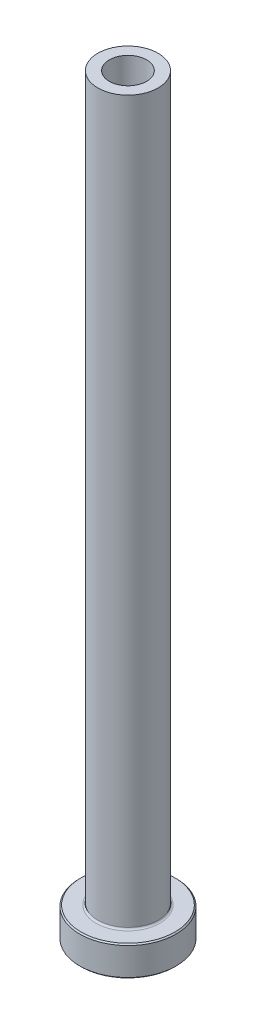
ISO-10303-21;
HEADER;
FILE_DESCRIPTION(('STEP AP214'),'2;1');
FILE_NAME('part.step','',(''),(''),'','','');
FILE_SCHEMA(('AUTOMOTIVE_DESIGN { 1 0 10303 214 1 1 1 1 }'));
ENDSEC;
DATA;
#1=APPLICATION_CONTEXT('core data for automotive mechanical design processes');
#2=APPLICATION_PROTOCOL_DEFINITION('international standard','automotive_design',2000,#1);
#3=PRODUCT_CONTEXT('',#1,'mechanical');
#4=PRODUCT('Part','Part','',(#3));
#5=PRODUCT_RELATED_PRODUCT_CATEGORY('part','',(#4));
#6=PRODUCT_DEFINITION_FORMATION('','',#4);
#7=PRODUCT_DEFINITION_CONTEXT('part definition',#1,'design');
#8=PRODUCT_DEFINITION('design','',#6,#7);
#9=PRODUCT_DEFINITION_SHAPE('','',#8);
#10=(LENGTH_UNIT() NAMED_UNIT(*) SI_UNIT(.MILLI.,.METRE.));
#11=(NAMED_UNIT(*) PLANE_ANGLE_UNIT() SI_UNIT($,.RADIAN.));
#12=(NAMED_UNIT(*) SI_UNIT($,.STERADIAN.) SOLID_ANGLE_UNIT());
#13=UNCERTAINTY_MEASURE_WITH_UNIT(LENGTH_MEASURE(1.E-05),#10,'distance_accuracy_value','');
#14=(GEOMETRIC_REPRESENTATION_CONTEXT(3) GLOBAL_UNCERTAINTY_ASSIGNED_CONTEXT((#13)) GLOBAL_UNIT_ASSIGNED_CONTEXT((#10,
#11,#12)) REPRESENTATION_CONTEXT('',''));
#15=CARTESIAN_POINT('',(0.,0.,0.));
#16=DIRECTION('',(0.,0.,1.));
#17=DIRECTION('',(1.,0.,0.));
#18=AXIS2_PLACEMENT_3D('',#15,#16,#17);
#19=CARTESIAN_POINT('',(0.,92.1876809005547,0.));
#20=DIRECTION('',(0.,1.,0.));
#21=DIRECTION('',(0.,0.,1.));
#22=AXIS2_PLACEMENT_3D('',#19,#20,#21);
#23=CYLINDRICAL_SURFACE('',#22,3.1);
#24=CARTESIAN_POINT('',(0.,125.,0.));
#25=DIRECTION('',(0.,1.,0.));
#26=DIRECTION('',(0.,0.,1.));
#27=AXIS2_PLACEMENT_3D('',#24,#25,#26);
#28=CIRCLE('',#27,3.1);
#29=CARTESIAN_POINT('',(0.,125.,3.1));
#30=VERTEX_POINT('',#29);
#31=EDGE_CURVE('E62',#30,#30,#28,.T.);
#32=ORIENTED_EDGE('',*,*,#31,.T.);
#33=EDGE_LOOP('',(#32));
#34=FACE_BOUND('',#33,.T.);
#35=CARTESIAN_POINT('',(0.,80.,0.));
#36=DIRECTION('',(0.,1.,0.));
#37=DIRECTION('',(0.,0.,1.));
#38=AXIS2_PLACEMENT_3D('',#35,#36,#37);
#39=CIRCLE('',#38,3.1);
#40=CARTESIAN_POINT('',(0.,80.,3.1));
#41=VERTEX_POINT('',#40);
#42=EDGE_CURVE('E71',#41,#41,#39,.T.);
#43=ORIENTED_EDGE('',*,*,#42,.F.);
#44=EDGE_LOOP('',(#43));
#45=FACE_BOUND('',#44,.T.);
#46=ADVANCED_FACE('F30',(#34,#45),#23,.F.);
#47=CARTESIAN_POINT('',(-3.1,125.,0.));
#48=DIRECTION('',(0.,1.,0.));
#49=DIRECTION('',(0.,0.,1.));
#50=AXIS2_PLACEMENT_3D('',#47,#48,#49);
#51=PLANE('',#50);
#52=CARTESIAN_POINT('',(0.,125.,0.));
#53=DIRECTION('',(0.,1.,0.));
#54=DIRECTION('',(0.,0.,1.));
#55=AXIS2_PLACEMENT_3D('',#52,#53,#54);
#56=CIRCLE('',#55,5.);
#57=CARTESIAN_POINT('',(0.,125.,5.));
#58=VERTEX_POINT('',#57);
#59=EDGE_CURVE('E65',#58,#58,#56,.T.);
#60=ORIENTED_EDGE('',*,*,#59,.T.);
#61=EDGE_LOOP('',(#60));
#62=FACE_BOUND('',#61,.T.);
#63=ORIENTED_EDGE('',*,*,#31,.F.);
#64=EDGE_LOOP('',(#63));
#65=FACE_BOUND('',#64,.T.);
#66=ADVANCED_FACE('F79',(#62,#65),#51,.T.);
#67=CARTESIAN_POINT('',(0.,92.1876809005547,0.));
#68=DIRECTION('',(0.,1.,0.));
#69=DIRECTION('',(0.,0.,1.));
#70=AXIS2_PLACEMENT_3D('',#67,#68,#69);
#71=CYLINDRICAL_SURFACE('',#70,5.);
#72=CARTESIAN_POINT('',(0.,5.3,0.));
#73=DIRECTION('',(0.,1.,0.));
#74=DIRECTION('',(0.,0.,1.));
#75=AXIS2_PLACEMENT_3D('',#72,#73,#74);
#76=CIRCLE('',#75,5.);
#77=CARTESIAN_POINT('',(0.,5.3,5.));
#78=VERTEX_POINT('',#77);
#79=EDGE_CURVE('E59',#78,#78,#76,.T.);
#80=ORIENTED_EDGE('',*,*,#79,.T.);
#81=EDGE_LOOP('',(#80));
#82=FACE_BOUND('',#81,.T.);
#83=ORIENTED_EDGE('',*,*,#59,.F.);
#84=EDGE_LOOP('',(#83));
#85=FACE_BOUND('',#84,.T.);
#86=ADVANCED_FACE('F85',(#82,#85),#71,.T.);
#87=CARTESIAN_POINT('',(-4.99999999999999,5.,0.));
#88=DIRECTION('',(0.,1.,0.));
#89=DIRECTION('',(0.,0.,1.));
#90=AXIS2_PLACEMENT_3D('',#87,#88,#89);
#91=PLANE('',#90);
#92=CARTESIAN_POINT('',(0.,5.,0.));
#93=DIRECTION('',(0.,1.,0.));
#94=DIRECTION('',(0.,0.,1.));
#95=AXIS2_PLACEMENT_3D('',#92,#93,#94);
#96=CIRCLE('',#95,7.79999999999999);
#97=CARTESIAN_POINT('',(0.,5.,7.79999999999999));
#98=VERTEX_POINT('',#97);
#99=EDGE_CURVE('E53',#98,#98,#96,.T.);
#100=ORIENTED_EDGE('',*,*,#99,.T.);
#101=EDGE_LOOP('',(#100));
#102=FACE_BOUND('',#101,.T.);
#103=CARTESIAN_POINT('',(0.,5.,0.));
#104=DIRECTION('',(0.,1.,0.));
#105=DIRECTION('',(0.,0.,1.));
#106=AXIS2_PLACEMENT_3D('',#103,#104,#105);
#107=CIRCLE('',#106,5.3);
#108=CARTESIAN_POINT('',(0.,5.,5.3));
#109=VERTEX_POINT('',#108);
#110=EDGE_CURVE('E56',#109,#109,#107,.F.);
#111=ORIENTED_EDGE('',*,*,#110,.T.);
#112=EDGE_LOOP('',(#111));
#113=FACE_BOUND('',#112,.T.);
#114=ADVANCED_FACE('F111',(#102,#113),#91,.T.);
#115=CARTESIAN_POINT('',(0.,92.1876809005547,0.));
#116=DIRECTION('',(0.,1.,0.));
#117=DIRECTION('',(0.,0.,1.));
#118=AXIS2_PLACEMENT_3D('',#115,#116,#117);
#119=CYLINDRICAL_SURFACE('',#118,7.99999999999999);
#120=CARTESIAN_POINT('',(0.,4.8,0.));
#121=DIRECTION('',(0.,1.,0.));
#122=DIRECTION('',(0.,0.,1.));
#123=AXIS2_PLACEMENT_3D('',#120,#121,#122);
#124=CIRCLE('',#123,7.99999999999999);
#125=CARTESIAN_POINT('',(0.,4.8,7.99999999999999));
#126=VERTEX_POINT('',#125);
#127=EDGE_CURVE('E45',#126,#126,#124,.F.);
#128=ORIENTED_EDGE('',*,*,#127,.T.);
#129=EDGE_LOOP('',(#128));
#130=FACE_BOUND('',#129,.T.);
#131=CARTESIAN_POINT('',(0.,0.20000000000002,0.));
#132=DIRECTION('',(0.,-1.,0.));
#133=DIRECTION('',(0.,0.,-1.));
#134=AXIS2_PLACEMENT_3D('',#131,#132,#133);
#135=CIRCLE('',#134,7.99999999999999);
#136=CARTESIAN_POINT('',(0.,0.20000000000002,-7.99999999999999));
#137=VERTEX_POINT('',#136);
#138=EDGE_CURVE('E50',#137,#137,#135,.F.);
#139=ORIENTED_EDGE('',*,*,#138,.T.);
#140=EDGE_LOOP('',(#139));
#141=FACE_BOUND('',#140,.T.);
#142=ADVANCED_FACE('F108',(#130,#141),#119,.T.);
#143=CARTESIAN_POINT('',(-7.99999999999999,0.,0.));
#144=DIRECTION('',(0.,-1.,0.));
#145=DIRECTION('',(0.,0.,-1.));
#146=AXIS2_PLACEMENT_3D('',#143,#144,#145);
#147=PLANE('',#146);
#148=CARTESIAN_POINT('',(0.,0.,0.));
#149=DIRECTION('',(0.,-1.,0.));
#150=DIRECTION('',(0.,0.,-1.));
#151=AXIS2_PLACEMENT_3D('',#148,#149,#150);
#152=CIRCLE('',#151,3.84999999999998);
#153=CARTESIAN_POINT('',(0.,0.,-3.84999999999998));
#154=VERTEX_POINT('',#153);
#155=EDGE_CURVE('E37',#154,#154,#152,.F.);
#156=ORIENTED_EDGE('',*,*,#155,.T.);
#157=EDGE_LOOP('',(#156));
#158=FACE_BOUND('',#157,.T.);
#159=CARTESIAN_POINT('',(0.,0.,0.));
#160=DIRECTION('',(0.,-1.,0.));
#161=DIRECTION('',(0.,0.,-1.));
#162=AXIS2_PLACEMENT_3D('',#159,#160,#161);
#163=CIRCLE('',#162,7.79999999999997);
#164=CARTESIAN_POINT('',(0.,0.,-7.79999999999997));
#165=VERTEX_POINT('',#164);
#166=EDGE_CURVE('E41',#165,#165,#163,.T.);
#167=ORIENTED_EDGE('',*,*,#166,.T.);
#168=EDGE_LOOP('',(#167));
#169=FACE_BOUND('',#168,.T.);
#170=ADVANCED_FACE('F110',(#158,#169),#147,.T.);
#171=CARTESIAN_POINT('',(0.,92.1876809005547,0.));
#172=DIRECTION('',(0.,1.,0.));
#173=DIRECTION('',(0.,0.,1.));
#174=AXIS2_PLACEMENT_3D('',#171,#172,#173);
#175=CYLINDRICAL_SURFACE('',#174,3.34999999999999);
#176=CARTESIAN_POINT('',(0.,0.5,0.));
#177=DIRECTION('',(0.,-1.,0.));
#178=DIRECTION('',(0.,0.,-1.));
#179=AXIS2_PLACEMENT_3D('',#176,#177,#178);
#180=CIRCLE('',#179,3.34999999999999);
#181=CARTESIAN_POINT('',(0.,0.5,-3.34999999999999));
#182=VERTEX_POINT('',#181);
#183=EDGE_CURVE('E10',#182,#182,#180,.T.);
#184=ORIENTED_EDGE('',*,*,#183,.T.);
#185=EDGE_LOOP('',(#184));
#186=FACE_BOUND('',#185,.T.);
#187=CARTESIAN_POINT('',(0.,68.,0.));
#188=DIRECTION('',(0.,1.,0.));
#189=DIRECTION('',(0.,0.,1.));
#190=AXIS2_PLACEMENT_3D('',#187,#188,#189);
#191=CIRCLE('',#190,3.35);
#192=CARTESIAN_POINT('',(0.,68.,3.35));
#193=VERTEX_POINT('',#192);
#194=EDGE_CURVE('E68',#193,#193,#191,.T.);
#195=ORIENTED_EDGE('',*,*,#194,.T.);
#196=EDGE_LOOP('',(#195));
#197=FACE_BOUND('',#196,.T.);
#198=ADVANCED_FACE('F118',(#186,#197),#175,.F.);
#199=CARTESIAN_POINT('',(0.,68.,0.));
#200=DIRECTION('',(0.,-1.,0.));
#201=DIRECTION('',(0.,0.,-1.));
#202=AXIS2_PLACEMENT_3D('',#199,#200,#201);
#203=CONICAL_SURFACE('',#202,3.35,0.0208303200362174);
#204=ORIENTED_EDGE('',*,*,#42,.T.);
#205=EDGE_LOOP('',(#204));
#206=FACE_BOUND('',#205,.T.);
#207=ORIENTED_EDGE('',*,*,#194,.F.);
#208=EDGE_LOOP('',(#207));
#209=FACE_BOUND('',#208,.T.);
#210=ADVANCED_FACE('F75',(#206,#209),#203,.F.);
#211=CARTESIAN_POINT('',(0.,5.3,0.));
#212=DIRECTION('',(0.,1.,0.));
#213=DIRECTION('',(0.,0.,1.));
#214=AXIS2_PLACEMENT_3D('',#211,#212,#213);
#215=TOROIDAL_SURFACE('',#214,5.3,0.3);
#216=ORIENTED_EDGE('',*,*,#110,.F.);
#217=EDGE_LOOP('',(#216));
#218=FACE_BOUND('',#217,.T.);
#219=ORIENTED_EDGE('',*,*,#79,.F.);
#220=EDGE_LOOP('',(#219));
#221=FACE_BOUND('',#220,.T.);
#222=ADVANCED_FACE('F90',(#218,#221),#215,.F.);
#223=CARTESIAN_POINT('',(0.,5.,0.));
#224=DIRECTION('',(0.,-1.,0.));
#225=DIRECTION('',(0.,0.,-1.));
#226=AXIS2_PLACEMENT_3D('',#223,#224,#225);
#227=CONICAL_SURFACE('',#226,7.79999999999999,0.78539816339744);
#228=ORIENTED_EDGE('',*,*,#127,.F.);
#229=EDGE_LOOP('',(#228));
#230=FACE_BOUND('',#229,.T.);
#231=ORIENTED_EDGE('',*,*,#99,.F.);
#232=EDGE_LOOP('',(#231));
#233=FACE_BOUND('',#232,.T.);
#234=ADVANCED_FACE('F93',(#230,#233),#227,.T.);
#235=CARTESIAN_POINT('',(0.,0.20000000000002,0.));
#236=DIRECTION('',(0.,1.,0.));
#237=DIRECTION('',(0.,0.,1.));
#238=AXIS2_PLACEMENT_3D('',#235,#236,#237);
#239=CONICAL_SURFACE('',#238,7.99999999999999,0.78539816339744);
#240=ORIENTED_EDGE('',*,*,#166,.F.);
#241=EDGE_LOOP('',(#240));
#242=FACE_BOUND('',#241,.T.);
#243=ORIENTED_EDGE('',*,*,#138,.F.);
#244=EDGE_LOOP('',(#243));
#245=FACE_BOUND('',#244,.T.);
#246=ADVANCED_FACE('F96',(#242,#245),#239,.T.);
#247=CARTESIAN_POINT('',(0.,0.,0.));
#248=DIRECTION('',(0.,-1.,0.));
#249=DIRECTION('',(0.,0.,-1.));
#250=AXIS2_PLACEMENT_3D('',#247,#248,#249);
#251=CONICAL_SURFACE('',#250,3.84999999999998,0.785398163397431);
#252=ORIENTED_EDGE('',*,*,#183,.F.);
#253=EDGE_LOOP('',(#252));
#254=FACE_BOUND('',#253,.T.);
#255=ORIENTED_EDGE('',*,*,#155,.F.);
#256=EDGE_LOOP('',(#255));
#257=FACE_BOUND('',#256,.T.);
#258=ADVANCED_FACE('F32',(#254,#257),#251,.F.);
#259=CLOSED_SHELL('',(#46,#66,#86,#114,#142,#170,#198,#210,#222,#234,#246,#258));
#260=MANIFOLD_SOLID_BREP('B2',#259);
#261=ADVANCED_BREP_SHAPE_REPRESENTATION('',(#18,#260),#14);
#262=SHAPE_DEFINITION_REPRESENTATION(#9,#261);
ENDSEC;
END-ISO-10303-21;
